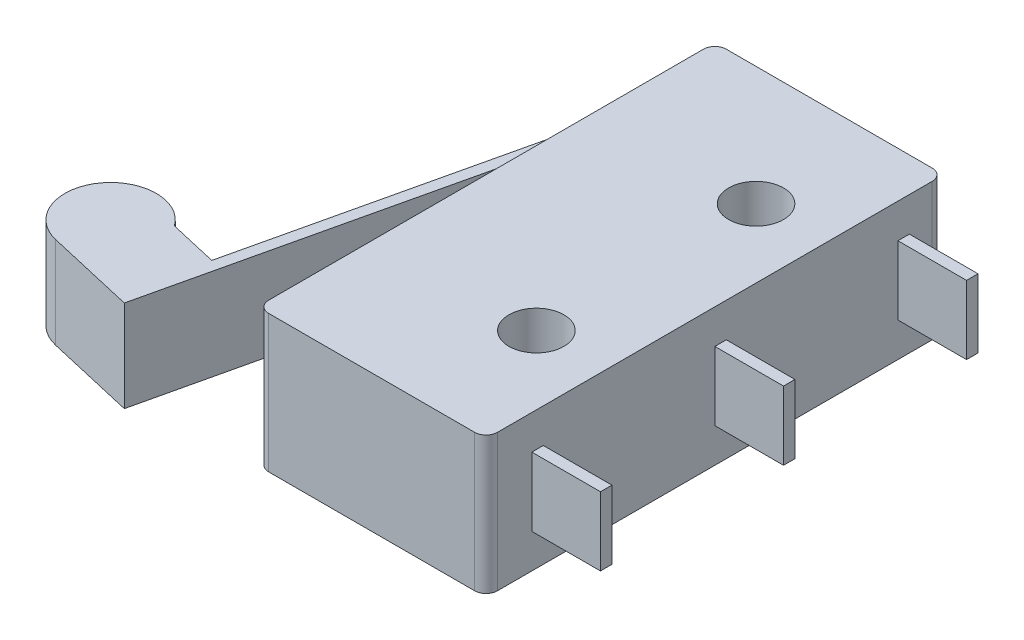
from build123d import *

# Parameters (mm, degrees)
ESQUISSE1_W                = 10
ESQUISSE1_H                = 20
ESQUISSE1_R                = 1.2
BOSS_EXTRU_1_DEPTH         = 3
BOSS_EXTRU_2_DEPTH         = 2
CONG_1_R                   = 0.5
ESQUISSE3_W                = 3
ESQUISSE3_H                = 0.5
BOSS_EXTRU_3_DEPTH         = 1.5
R_P_TITION_LIN_AIRE1_COUNT = 3
R_P_TITION_LIN_AIRE1_PITCH = 8


with BuildPart() as part:
    # Esquisse1 → Boss.-Extru.1 (new, symmetric)
    with BuildSketch(Plane(origin=(0, 0, 0), x_dir=(1, 0, 0), z_dir=(0, 1, 0))):
        Rectangle(ESQUISSE1_W, ESQUISSE1_H)
        with Locations(Location((2, 4.8, 0), (0, 0, 270))):
            Circle(ESQUISSE1_R, mode=Mode.SUBTRACT)
        with Locations(Location((2, -4.8, 0), (0, 0, 270))):
            Circle(ESQUISSE1_R, mode=Mode.SUBTRACT)
    extrude(amount=BOSS_EXTRU_1_DEPTH, both=True)

    # Esquisse2 → Boss.-Extru.2 (add, symmetric)
    with BuildSketch(Plane(origin=(0, 0, 0), x_dir=(1, 0, 0), z_dir=(0, 1, 0))):
        with BuildLine():
            Line((-5, 8), (-8.74897532, -8.238596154))
            Line((-8.74897532, -8.238596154), (-10.870300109, -7.748849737))
            ThreePointArc((-10.870300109, -7.748849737), (-14.160512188, -7.802993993), (-12.946599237, -10.86156269))
            Line((-12.946599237, -10.86156269), (-9.049118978, -11.761366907))
            Line((-9.049118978, -11.761366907), (-5, 5.777294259))
            Line((-5, 5.777294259), (-5, 8))
        make_face()
    extrude(amount=BOSS_EXTRU_2_DEPTH, both=True)

    # Cong_1
    cong_1_edges = [part.edges().sort_by_distance(p)[0] for p in [
        (5, 0, 10),
        (-5, 0, 10),
        (-5, 0, -10),
        (5, 0, -10),
    ]]
    fillet(cong_1_edges, radius=CONG_1_R)

    # Esquisse3 → Boss.-Extru.3 (add, symmetric)
    with BuildSketch(Plane(origin=(0, 0, 0), x_dir=(1, 0, 0), z_dir=(0, 1, 0))):
        with Locations((6.5, 8.25)):
            Rectangle(ESQUISSE3_W, ESQUISSE3_H)
    boss_extru_3 = extrude(amount=BOSS_EXTRU_3_DEPTH, both=True)

    # R_p_tition lin_aire1: Boss.-Extru.3 ×3
    with Locations(*[(0, 0, i * R_P_TITION_LIN_AIRE1_PITCH) for i in range(1, R_P_TITION_LIN_AIRE1_COUNT)]):
        add(boss_extru_3)


solid = part.part
